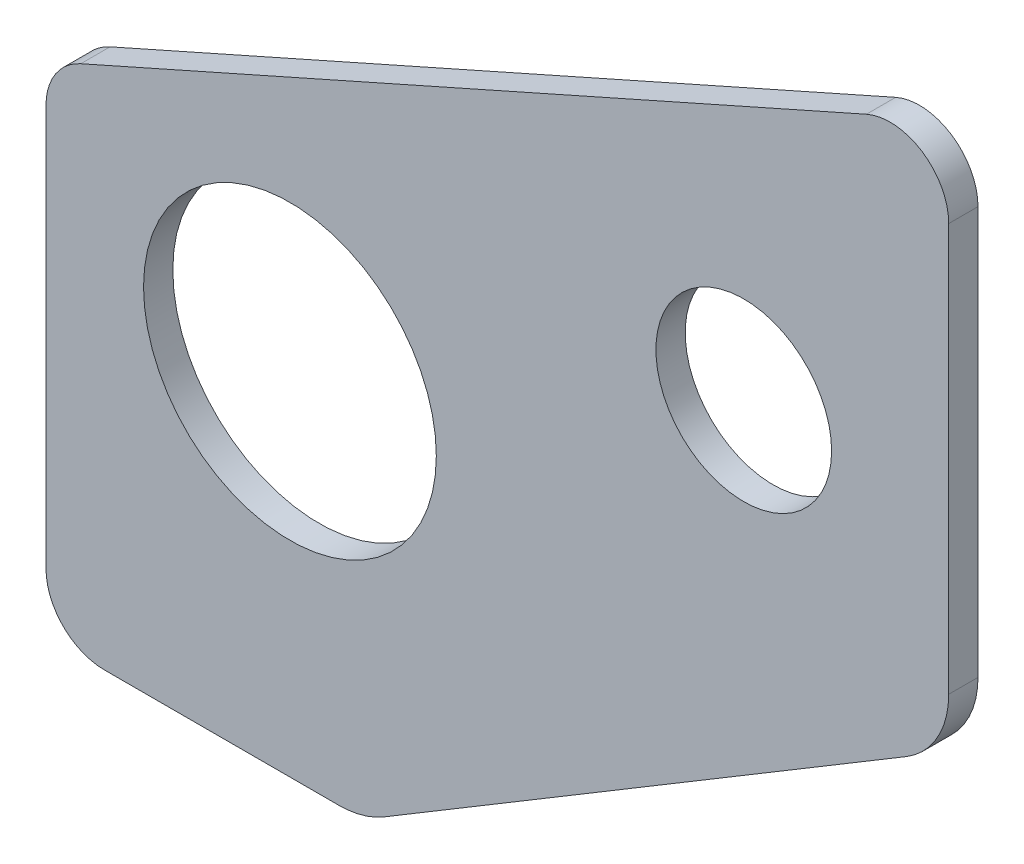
ISO-10303-21;
HEADER;
FILE_DESCRIPTION(('STEP AP214'),'2;1');
FILE_NAME('part.step','',(''),(''),'','','');
FILE_SCHEMA(('AUTOMOTIVE_DESIGN { 1 0 10303 214 1 1 1 1 }'));
ENDSEC;
DATA;
#1=APPLICATION_CONTEXT('core data for automotive mechanical design processes');
#2=APPLICATION_PROTOCOL_DEFINITION('international standard','automotive_design',2000,#1);
#3=PRODUCT_CONTEXT('',#1,'mechanical');
#4=PRODUCT('Part','Part','',(#3));
#5=PRODUCT_RELATED_PRODUCT_CATEGORY('part','',(#4));
#6=PRODUCT_DEFINITION_FORMATION('','',#4);
#7=PRODUCT_DEFINITION_CONTEXT('part definition',#1,'design');
#8=PRODUCT_DEFINITION('design','',#6,#7);
#9=PRODUCT_DEFINITION_SHAPE('','',#8);
#10=(LENGTH_UNIT() NAMED_UNIT(*) SI_UNIT(.MILLI.,.METRE.));
#11=(NAMED_UNIT(*) PLANE_ANGLE_UNIT() SI_UNIT($,.RADIAN.));
#12=(NAMED_UNIT(*) SI_UNIT($,.STERADIAN.) SOLID_ANGLE_UNIT());
#13=UNCERTAINTY_MEASURE_WITH_UNIT(LENGTH_MEASURE(1.E-05),#10,'distance_accuracy_value','');
#14=(GEOMETRIC_REPRESENTATION_CONTEXT(3) GLOBAL_UNCERTAINTY_ASSIGNED_CONTEXT((#13)) GLOBAL_UNIT_ASSIGNED_CONTEXT((#10,
#11,#12)) REPRESENTATION_CONTEXT('',''));
#15=CARTESIAN_POINT('',(0.,0.,0.));
#16=DIRECTION('',(0.,0.,1.));
#17=DIRECTION('',(1.,0.,0.));
#18=AXIS2_PLACEMENT_3D('',#15,#16,#17);
#19=CARTESIAN_POINT('',(14.3847558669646,58.8661644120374,-1.));
#20=DIRECTION('',(0.,0.,1.));
#21=DIRECTION('',(1.,0.,0.));
#22=AXIS2_PLACEMENT_3D('',#19,#20,#21);
#23=CYLINDRICAL_SURFACE('',#22,2.00000000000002);
#24=CARTESIAN_POINT('',(14.3847558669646,58.8661644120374,0.));
#25=DIRECTION('',(0.,0.,1.));
#26=DIRECTION('',(-1.,0.,0.));
#27=AXIS2_PLACEMENT_3D('',#24,#25,#26);
#28=CIRCLE('',#27,2.00000000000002);
#29=CARTESIAN_POINT('',(16.3847558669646,58.8661644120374,0.));
#30=VERTEX_POINT('',#29);
#31=CARTESIAN_POINT('',(13.5726806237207,60.6938771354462,0.));
#32=VERTEX_POINT('',#31);
#33=EDGE_CURVE('E141',#30,#32,#28,.T.);
#34=ORIENTED_EDGE('',*,*,#33,.F.);
#35=DIRECTION('',(0.,0.,1.));
#36=VECTOR('',#35,1.);
#37=CARTESIAN_POINT('',(16.3847558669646,58.8661644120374,-1.));
#38=LINE('',#37,#36);
#39=CARTESIAN_POINT('',(16.3847558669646,58.8661644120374,-1.));
#40=VERTEX_POINT('',#39);
#41=EDGE_CURVE('E11',#40,#30,#38,.T.);
#42=ORIENTED_EDGE('',*,*,#41,.F.);
#43=CARTESIAN_POINT('',(14.3847558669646,58.8661644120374,-1.));
#44=DIRECTION('',(0.,0.,1.));
#45=DIRECTION('',(-1.,0.,0.));
#46=AXIS2_PLACEMENT_3D('',#43,#44,#45);
#47=CIRCLE('',#46,2.00000000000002);
#48=CARTESIAN_POINT('',(13.5726806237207,60.6938771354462,-1.));
#49=VERTEX_POINT('',#48);
#50=EDGE_CURVE('E168',#40,#49,#47,.T.);
#51=ORIENTED_EDGE('',*,*,#50,.T.);
#52=DIRECTION('',(0.,0.,1.));
#53=VECTOR('',#52,1.);
#54=CARTESIAN_POINT('',(13.5726806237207,60.6938771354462,-1.));
#55=LINE('',#54,#53);
#56=EDGE_CURVE('E35',#49,#32,#55,.T.);
#57=ORIENTED_EDGE('',*,*,#56,.T.);
#58=EDGE_LOOP('',(#34,#42,#51,#57));
#59=FACE_BOUND('',#58,.T.);
#60=ADVANCED_FACE('F32',(#59),#23,.T.);
#61=CARTESIAN_POINT('',(16.3847558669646,58.8661644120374,-1.));
#62=DIRECTION('',(1.,0.,0.));
#63=DIRECTION('',(0.,0.,-1.));
#64=AXIS2_PLACEMENT_3D('',#61,#62,#63);
#65=PLANE('',#64);
#66=DIRECTION('',(0.,1.,0.));
#67=VECTOR('',#66,1.);
#68=CARTESIAN_POINT('',(16.3847558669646,58.8661644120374,0.));
#69=LINE('',#68,#67);
#70=CARTESIAN_POINT('',(16.3847558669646,44.9433167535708,0.));
#71=VERTEX_POINT('',#70);
#72=EDGE_CURVE('E166',#71,#30,#69,.T.);
#73=ORIENTED_EDGE('',*,*,#72,.F.);
#74=DIRECTION('',(0.,0.,1.));
#75=VECTOR('',#74,1.);
#76=CARTESIAN_POINT('',(16.3847558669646,44.9433167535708,-1.));
#77=LINE('',#76,#75);
#78=CARTESIAN_POINT('',(16.3847558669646,44.9433167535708,-1.));
#79=VERTEX_POINT('',#78);
#80=EDGE_CURVE('E41',#79,#71,#77,.T.);
#81=ORIENTED_EDGE('',*,*,#80,.F.);
#82=DIRECTION('',(0.,1.,0.));
#83=VECTOR('',#82,1.);
#84=CARTESIAN_POINT('',(16.3847558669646,58.8661644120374,-1.));
#85=LINE('',#84,#83);
#86=EDGE_CURVE('E131',#79,#40,#85,.T.);
#87=ORIENTED_EDGE('',*,*,#86,.T.);
#88=ORIENTED_EDGE('',*,*,#41,.T.);
#89=EDGE_LOOP('',(#73,#81,#87,#88));
#90=FACE_BOUND('',#89,.T.);
#91=ADVANCED_FACE('F184',(#90),#65,.T.);
#92=CARTESIAN_POINT('',(13.3847558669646,44.9433167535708,-1.));
#93=DIRECTION('',(0.,0.,1.));
#94=DIRECTION('',(1.,0.,0.));
#95=AXIS2_PLACEMENT_3D('',#92,#93,#94);
#96=CYLINDRICAL_SURFACE('',#95,3.00000000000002);
#97=CARTESIAN_POINT('',(13.3847558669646,44.9433167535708,0.));
#98=DIRECTION('',(0.,0.,1.));
#99=DIRECTION('',(-1.,0.,0.));
#100=AXIS2_PLACEMENT_3D('',#97,#98,#99);
#101=CIRCLE('',#100,3.00000000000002);
#102=CARTESIAN_POINT('',(14.9282431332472,42.3708379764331,0.));
#103=VERTEX_POINT('',#102);
#104=EDGE_CURVE('E118',#103,#71,#101,.T.);
#105=ORIENTED_EDGE('',*,*,#104,.F.);
#106=DIRECTION('',(0.,0.,1.));
#107=VECTOR('',#106,1.);
#108=CARTESIAN_POINT('',(14.9282431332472,42.3708379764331,-1.));
#109=LINE('',#108,#107);
#110=CARTESIAN_POINT('',(14.9282431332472,42.3708379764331,-1.));
#111=VERTEX_POINT('',#110);
#112=EDGE_CURVE('E113',#111,#103,#109,.T.);
#113=ORIENTED_EDGE('',*,*,#112,.F.);
#114=CARTESIAN_POINT('',(13.3847558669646,44.9433167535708,-1.));
#115=DIRECTION('',(0.,0.,1.));
#116=DIRECTION('',(-1.,0.,0.));
#117=AXIS2_PLACEMENT_3D('',#114,#115,#116);
#118=CIRCLE('',#117,3.00000000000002);
#119=EDGE_CURVE('E116',#111,#79,#118,.T.);
#120=ORIENTED_EDGE('',*,*,#119,.T.);
#121=ORIENTED_EDGE('',*,*,#80,.T.);
#122=EDGE_LOOP('',(#105,#113,#120,#121));
#123=FACE_BOUND('',#122,.T.);
#124=ADVANCED_FACE('F115',(#123),#96,.T.);
#125=CARTESIAN_POINT('',(14.9282431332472,42.3708379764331,-1.));
#126=DIRECTION('',(0.514495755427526,-0.857492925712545,0.));
#127=DIRECTION('',(0.857492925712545,0.514495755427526,0.));
#128=AXIS2_PLACEMENT_3D('',#125,#126,#127);
#129=PLANE('',#128);
#130=DIRECTION('',(0.857492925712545,0.514495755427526,0.));
#131=VECTOR('',#130,1.);
#132=CARTESIAN_POINT('',(14.9282431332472,42.3708379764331,0.));
#133=LINE('',#132,#131);
#134=CARTESIAN_POINT('',(-2.90270876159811,31.672266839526,0.));
#135=VERTEX_POINT('',#134);
#136=EDGE_CURVE('E163',#135,#103,#133,.T.);
#137=ORIENTED_EDGE('',*,*,#136,.F.);
#138=DIRECTION('',(0.,0.,1.));
#139=VECTOR('',#138,1.);
#140=CARTESIAN_POINT('',(-2.90270876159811,31.672266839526,-1.));
#141=LINE('',#140,#139);
#142=CARTESIAN_POINT('',(-2.90270876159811,31.672266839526,-1.));
#143=VERTEX_POINT('',#142);
#144=EDGE_CURVE('E123',#143,#135,#141,.T.);
#145=ORIENTED_EDGE('',*,*,#144,.F.);
#146=DIRECTION('',(0.857492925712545,0.514495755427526,0.));
#147=VECTOR('',#146,1.);
#148=CARTESIAN_POINT('',(14.9282431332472,42.3708379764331,-1.));
#149=LINE('',#148,#147);
#150=EDGE_CURVE('E129',#143,#111,#149,.T.);
#151=ORIENTED_EDGE('',*,*,#150,.T.);
#152=ORIENTED_EDGE('',*,*,#112,.T.);
#153=EDGE_LOOP('',(#137,#145,#151,#152));
#154=FACE_BOUND('',#153,.T.);
#155=ADVANCED_FACE('F133',(#154),#129,.T.);
#156=CARTESIAN_POINT('',(-4.4461960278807,34.2447456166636,-1.));
#157=DIRECTION('',(0.,0.,1.));
#158=DIRECTION('',(1.,0.,0.));
#159=AXIS2_PLACEMENT_3D('',#156,#157,#158);
#160=CYLINDRICAL_SURFACE('',#159,3.00000000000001);
#161=CARTESIAN_POINT('',(-4.4461960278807,34.2447456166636,0.));
#162=DIRECTION('',(0.,0.,1.));
#163=DIRECTION('',(-1.,0.,0.));
#164=AXIS2_PLACEMENT_3D('',#161,#162,#163);
#165=CIRCLE('',#164,3.00000000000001);
#166=CARTESIAN_POINT('',(-4.44619602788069,31.2447456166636,0.));
#167=VERTEX_POINT('',#166);
#168=EDGE_CURVE('E160',#167,#135,#165,.T.);
#169=ORIENTED_EDGE('',*,*,#168,.F.);
#170=DIRECTION('',(0.,0.,1.));
#171=VECTOR('',#170,1.);
#172=CARTESIAN_POINT('',(-4.44619602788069,31.2447456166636,-1.));
#173=LINE('',#172,#171);
#174=CARTESIAN_POINT('',(-4.44619602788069,31.2447456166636,-1.));
#175=VERTEX_POINT('',#174);
#176=EDGE_CURVE('E172',#175,#167,#173,.T.);
#177=ORIENTED_EDGE('',*,*,#176,.F.);
#178=CARTESIAN_POINT('',(-4.4461960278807,34.2447456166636,-1.));
#179=DIRECTION('',(0.,0.,1.));
#180=DIRECTION('',(-1.,0.,0.));
#181=AXIS2_PLACEMENT_3D('',#178,#179,#180);
#182=CIRCLE('',#181,3.00000000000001);
#183=EDGE_CURVE('E134',#175,#143,#182,.T.);
#184=ORIENTED_EDGE('',*,*,#183,.T.);
#185=ORIENTED_EDGE('',*,*,#144,.T.);
#186=EDGE_LOOP('',(#169,#177,#184,#185));
#187=FACE_BOUND('',#186,.T.);
#188=ADVANCED_FACE('F197',(#187),#160,.T.);
#189=CARTESIAN_POINT('',(-4.44619602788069,31.2447456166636,-1.));
#190=DIRECTION('',(0.,-1.,0.));
#191=DIRECTION('',(0.,0.,-1.));
#192=AXIS2_PLACEMENT_3D('',#189,#190,#191);
#193=PLANE('',#192);
#194=DIRECTION('',(1.,0.,0.));
#195=VECTOR('',#194,1.);
#196=CARTESIAN_POINT('',(-4.44619602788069,31.2447456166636,0.));
#197=LINE('',#196,#195);
#198=CARTESIAN_POINT('',(-12.4461960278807,31.2447456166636,0.));
#199=VERTEX_POINT('',#198);
#200=EDGE_CURVE('E157',#199,#167,#197,.T.);
#201=ORIENTED_EDGE('',*,*,#200,.F.);
#202=DIRECTION('',(0.,0.,1.));
#203=VECTOR('',#202,1.);
#204=CARTESIAN_POINT('',(-12.4461960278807,31.2447456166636,-1.));
#205=LINE('',#204,#203);
#206=CARTESIAN_POINT('',(-12.4461960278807,31.2447456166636,-1.));
#207=VERTEX_POINT('',#206);
#208=EDGE_CURVE('E174',#207,#199,#205,.T.);
#209=ORIENTED_EDGE('',*,*,#208,.F.);
#210=DIRECTION('',(1.,0.,0.));
#211=VECTOR('',#210,1.);
#212=CARTESIAN_POINT('',(-4.44619602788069,31.2447456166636,-1.));
#213=LINE('',#212,#211);
#214=EDGE_CURVE('E136',#207,#175,#213,.T.);
#215=ORIENTED_EDGE('',*,*,#214,.T.);
#216=ORIENTED_EDGE('',*,*,#176,.T.);
#217=EDGE_LOOP('',(#201,#209,#215,#216));
#218=FACE_BOUND('',#217,.T.);
#219=ADVANCED_FACE('F200',(#218),#193,.T.);
#220=CARTESIAN_POINT('',(-12.4461960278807,33.2447456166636,-1.));
#221=DIRECTION('',(0.,0.,1.));
#222=DIRECTION('',(1.,0.,0.));
#223=AXIS2_PLACEMENT_3D('',#220,#221,#222);
#224=CYLINDRICAL_SURFACE('',#223,2.00000000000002);
#225=CARTESIAN_POINT('',(-12.4461960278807,33.2447456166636,0.));
#226=DIRECTION('',(0.,0.,1.));
#227=DIRECTION('',(-1.,0.,0.));
#228=AXIS2_PLACEMENT_3D('',#225,#226,#227);
#229=CIRCLE('',#228,2.00000000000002);
#230=CARTESIAN_POINT('',(-14.4461960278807,33.2447456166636,0.));
#231=VERTEX_POINT('',#230);
#232=EDGE_CURVE('E154',#231,#199,#229,.T.);
#233=ORIENTED_EDGE('',*,*,#232,.F.);
#234=DIRECTION('',(0.,0.,1.));
#235=VECTOR('',#234,1.);
#236=CARTESIAN_POINT('',(-14.4461960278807,33.2447456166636,-1.));
#237=LINE('',#236,#235);
#238=CARTESIAN_POINT('',(-14.4461960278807,33.2447456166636,-1.));
#239=VERTEX_POINT('',#238);
#240=EDGE_CURVE('E176',#239,#231,#237,.T.);
#241=ORIENTED_EDGE('',*,*,#240,.F.);
#242=CARTESIAN_POINT('',(-12.4461960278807,33.2447456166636,-1.));
#243=DIRECTION('',(0.,0.,1.));
#244=DIRECTION('',(-1.,0.,0.));
#245=AXIS2_PLACEMENT_3D('',#242,#243,#244);
#246=CIRCLE('',#245,2.00000000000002);
#247=EDGE_CURVE('E260',#239,#207,#246,.T.);
#248=ORIENTED_EDGE('',*,*,#247,.T.);
#249=ORIENTED_EDGE('',*,*,#208,.T.);
#250=EDGE_LOOP('',(#233,#241,#248,#249));
#251=FACE_BOUND('',#250,.T.);
#252=ADVANCED_FACE('F204',(#251),#224,.T.);
#253=CARTESIAN_POINT('',(-14.4461960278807,33.2447456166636,-1.));
#254=DIRECTION('',(-1.,0.,0.));
#255=DIRECTION('',(0.,0.,1.));
#256=AXIS2_PLACEMENT_3D('',#253,#254,#255);
#257=PLANE('',#256);
#258=DIRECTION('',(0.,-1.,0.));
#259=VECTOR('',#258,1.);
#260=CARTESIAN_POINT('',(-14.4461960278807,33.2447456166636,0.));
#261=LINE('',#260,#259);
#262=CARTESIAN_POINT('',(-14.4461960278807,46.9448424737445,0.));
#263=VERTEX_POINT('',#262);
#264=EDGE_CURVE('E151',#263,#231,#261,.T.);
#265=ORIENTED_EDGE('',*,*,#264,.F.);
#266=DIRECTION('',(0.,0.,1.));
#267=VECTOR('',#266,1.);
#268=CARTESIAN_POINT('',(-14.4461960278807,46.9448424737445,-1.));
#269=LINE('',#268,#267);
#270=CARTESIAN_POINT('',(-14.4461960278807,46.9448424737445,-1.));
#271=VERTEX_POINT('',#270);
#272=EDGE_CURVE('E178',#271,#263,#269,.T.);
#273=ORIENTED_EDGE('',*,*,#272,.F.);
#274=DIRECTION('',(0.,-1.,0.));
#275=VECTOR('',#274,1.);
#276=CARTESIAN_POINT('',(-14.4461960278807,33.2447456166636,-1.));
#277=LINE('',#276,#275);
#278=EDGE_CURVE('E257',#271,#239,#277,.T.);
#279=ORIENTED_EDGE('',*,*,#278,.T.);
#280=ORIENTED_EDGE('',*,*,#240,.T.);
#281=EDGE_LOOP('',(#265,#273,#279,#280));
#282=FACE_BOUND('',#281,.T.);
#283=ADVANCED_FACE('F208',(#282),#257,.T.);
#284=CARTESIAN_POINT('',(-12.4461960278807,46.9448424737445,-1.));
#285=DIRECTION('',(0.,0.,1.));
#286=DIRECTION('',(1.,0.,0.));
#287=AXIS2_PLACEMENT_3D('',#284,#285,#286);
#288=CYLINDRICAL_SURFACE('',#287,2.00000000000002);
#289=CARTESIAN_POINT('',(-12.4461960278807,46.9448424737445,0.));
#290=DIRECTION('',(0.,0.,1.));
#291=DIRECTION('',(1.,0.,0.));
#292=AXIS2_PLACEMENT_3D('',#289,#290,#291);
#293=CIRCLE('',#292,2.00000000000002);
#294=CARTESIAN_POINT('',(-13.2582712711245,48.7725551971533,0.));
#295=VERTEX_POINT('',#294);
#296=EDGE_CURVE('E148',#295,#263,#293,.T.);
#297=ORIENTED_EDGE('',*,*,#296,.F.);
#298=DIRECTION('',(0.,0.,1.));
#299=VECTOR('',#298,1.);
#300=CARTESIAN_POINT('',(-13.2582712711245,48.7725551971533,-1.));
#301=LINE('',#300,#299);
#302=CARTESIAN_POINT('',(-13.2582712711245,48.7725551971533,-1.));
#303=VERTEX_POINT('',#302);
#304=EDGE_CURVE('E179',#303,#295,#301,.T.);
#305=ORIENTED_EDGE('',*,*,#304,.F.);
#306=CARTESIAN_POINT('',(-12.4461960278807,46.9448424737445,-1.));
#307=DIRECTION('',(0.,0.,1.));
#308=DIRECTION('',(1.,0.,0.));
#309=AXIS2_PLACEMENT_3D('',#306,#307,#308);
#310=CIRCLE('',#309,2.00000000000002);
#311=EDGE_CURVE('E254',#303,#271,#310,.T.);
#312=ORIENTED_EDGE('',*,*,#311,.T.);
#313=ORIENTED_EDGE('',*,*,#272,.T.);
#314=EDGE_LOOP('',(#297,#305,#312,#313));
#315=FACE_BOUND('',#314,.T.);
#316=ADVANCED_FACE('F212',(#315),#288,.T.);
#317=CARTESIAN_POINT('',(13.5726806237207,60.6938771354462,-1.));
#318=DIRECTION('',(-0.406037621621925,0.913856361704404,0.));
#319=DIRECTION('',(-0.913856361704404,-0.406037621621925,0.));
#320=AXIS2_PLACEMENT_3D('',#317,#318,#319);
#321=PLANE('',#320);
#322=DIRECTION('',(-0.913856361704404,-0.406037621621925,0.));
#323=VECTOR('',#322,1.);
#324=CARTESIAN_POINT('',(13.5726806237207,60.6938771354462,0.));
#325=LINE('',#324,#323);
#326=EDGE_CURVE('E144',#32,#295,#325,.T.);
#327=ORIENTED_EDGE('',*,*,#326,.F.);
#328=ORIENTED_EDGE('',*,*,#56,.F.);
#329=DIRECTION('',(-0.913856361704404,-0.406037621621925,0.));
#330=VECTOR('',#329,1.);
#331=CARTESIAN_POINT('',(13.5726806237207,60.6938771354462,-1.));
#332=LINE('',#331,#330);
#333=EDGE_CURVE('E252',#49,#303,#332,.T.);
#334=ORIENTED_EDGE('',*,*,#333,.T.);
#335=ORIENTED_EDGE('',*,*,#304,.T.);
#336=EDGE_LOOP('',(#327,#328,#334,#335));
#337=FACE_BOUND('',#336,.T.);
#338=ADVANCED_FACE('F181',(#337),#321,.T.);
#339=CARTESIAN_POINT('',(14.3847558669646,58.8661644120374,-1.));
#340=DIRECTION('',(0.,0.,-1.));
#341=DIRECTION('',(-1.,0.,0.));
#342=AXIS2_PLACEMENT_3D('',#339,#340,#341);
#343=PLANE('',#342);
#344=CARTESIAN_POINT('',(-6.11524413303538,43.2447456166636,-1.));
#345=DIRECTION('',(0.,0.,1.));
#346=DIRECTION('',(1.,0.,0.));
#347=AXIS2_PLACEMENT_3D('',#344,#345,#346);
#348=CIRCLE('',#347,5.);
#349=CARTESIAN_POINT('',(-1.11524413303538,43.2447456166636,-1.));
#350=VERTEX_POINT('',#349);
#351=EDGE_CURVE('E239',#350,#350,#348,.T.);
#352=ORIENTED_EDGE('',*,*,#351,.T.);
#353=EDGE_LOOP('',(#352));
#354=FACE_BOUND('',#353,.T.);
#355=CARTESIAN_POINT('',(9.38475586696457,50.1394691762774,-1.));
#356=DIRECTION('',(0.,0.,1.));
#357=DIRECTION('',(1.,0.,0.));
#358=AXIS2_PLACEMENT_3D('',#355,#356,#357);
#359=CIRCLE('',#358,3.);
#360=CARTESIAN_POINT('',(12.3847558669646,50.1394691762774,-1.));
#361=VERTEX_POINT('',#360);
#362=EDGE_CURVE('E145',#361,#361,#359,.T.);
#363=ORIENTED_EDGE('',*,*,#362,.T.);
#364=EDGE_LOOP('',(#363));
#365=FACE_BOUND('',#364,.T.);
#366=ORIENTED_EDGE('',*,*,#50,.F.);
#367=ORIENTED_EDGE('',*,*,#86,.F.);
#368=ORIENTED_EDGE('',*,*,#119,.F.);
#369=ORIENTED_EDGE('',*,*,#150,.F.);
#370=ORIENTED_EDGE('',*,*,#183,.F.);
#371=ORIENTED_EDGE('',*,*,#214,.F.);
#372=ORIENTED_EDGE('',*,*,#247,.F.);
#373=ORIENTED_EDGE('',*,*,#278,.F.);
#374=ORIENTED_EDGE('',*,*,#311,.F.);
#375=ORIENTED_EDGE('',*,*,#333,.F.);
#376=EDGE_LOOP('',(#366,#367,#368,#369,#370,#371,#372,#373,#374,#375));
#377=FACE_BOUND('',#376,.T.);
#378=ADVANCED_FACE('F127',(#354,#365,#377),#343,.T.);
#379=CARTESIAN_POINT('',(14.3847558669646,58.8661644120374,0.));
#380=DIRECTION('',(0.,0.,-1.));
#381=DIRECTION('',(-1.,0.,0.));
#382=AXIS2_PLACEMENT_3D('',#379,#380,#381);
#383=PLANE('',#382);
#384=CARTESIAN_POINT('',(-6.11524413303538,43.2447456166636,0.));
#385=DIRECTION('',(0.,0.,1.));
#386=DIRECTION('',(1.,0.,0.));
#387=AXIS2_PLACEMENT_3D('',#384,#385,#386);
#388=CIRCLE('',#387,5.);
#389=CARTESIAN_POINT('',(-1.11524413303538,43.2447456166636,0.));
#390=VERTEX_POINT('',#389);
#391=EDGE_CURVE('E242',#390,#390,#388,.T.);
#392=ORIENTED_EDGE('',*,*,#391,.F.);
#393=EDGE_LOOP('',(#392));
#394=FACE_BOUND('',#393,.T.);
#395=CARTESIAN_POINT('',(9.38475586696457,50.1394691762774,0.));
#396=DIRECTION('',(0.,0.,1.));
#397=DIRECTION('',(1.,0.,0.));
#398=AXIS2_PLACEMENT_3D('',#395,#396,#397);
#399=CIRCLE('',#398,3.);
#400=CARTESIAN_POINT('',(12.3847558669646,50.1394691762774,0.));
#401=VERTEX_POINT('',#400);
#402=EDGE_CURVE('E244',#401,#401,#399,.T.);
#403=ORIENTED_EDGE('',*,*,#402,.F.);
#404=EDGE_LOOP('',(#403));
#405=FACE_BOUND('',#404,.T.);
#406=ORIENTED_EDGE('',*,*,#33,.T.);
#407=ORIENTED_EDGE('',*,*,#326,.T.);
#408=ORIENTED_EDGE('',*,*,#296,.T.);
#409=ORIENTED_EDGE('',*,*,#264,.T.);
#410=ORIENTED_EDGE('',*,*,#232,.T.);
#411=ORIENTED_EDGE('',*,*,#200,.T.);
#412=ORIENTED_EDGE('',*,*,#168,.T.);
#413=ORIENTED_EDGE('',*,*,#136,.T.);
#414=ORIENTED_EDGE('',*,*,#104,.T.);
#415=ORIENTED_EDGE('',*,*,#72,.T.);
#416=EDGE_LOOP('',(#406,#407,#408,#409,#410,#411,#412,#413,#414,#415));
#417=FACE_BOUND('',#416,.T.);
#418=ADVANCED_FACE('F183',(#394,#405,#417),#383,.F.);
#419=CARTESIAN_POINT('',(9.38475586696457,50.1394691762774,-1.));
#420=DIRECTION('',(0.,0.,1.));
#421=DIRECTION('',(1.,0.,0.));
#422=AXIS2_PLACEMENT_3D('',#419,#420,#421);
#423=CYLINDRICAL_SURFACE('',#422,3.);
#424=ORIENTED_EDGE('',*,*,#362,.F.);
#425=EDGE_LOOP('',(#424));
#426=FACE_BOUND('',#425,.T.);
#427=ORIENTED_EDGE('',*,*,#402,.T.);
#428=EDGE_LOOP('',(#427));
#429=FACE_BOUND('',#428,.T.);
#430=ADVANCED_FACE('F224',(#426,#429),#423,.F.);
#431=CARTESIAN_POINT('',(-6.11524413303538,43.2447456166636,-1.));
#432=DIRECTION('',(0.,0.,1.));
#433=DIRECTION('',(1.,0.,0.));
#434=AXIS2_PLACEMENT_3D('',#431,#432,#433);
#435=CYLINDRICAL_SURFACE('',#434,5.);
#436=ORIENTED_EDGE('',*,*,#351,.F.);
#437=EDGE_LOOP('',(#436));
#438=FACE_BOUND('',#437,.T.);
#439=ORIENTED_EDGE('',*,*,#391,.T.);
#440=EDGE_LOOP('',(#439));
#441=FACE_BOUND('',#440,.T.);
#442=ADVANCED_FACE('F231',(#438,#441),#435,.F.);
#443=CLOSED_SHELL('',(#60,#91,#124,#155,#188,#219,#252,#283,#316,#338,#378,#418,#430,#442));
#444=MANIFOLD_SOLID_BREP('B2',#443);
#445=ADVANCED_BREP_SHAPE_REPRESENTATION('',(#18,#444),#14);
#446=SHAPE_DEFINITION_REPRESENTATION(#9,#445);
ENDSEC;
END-ISO-10303-21;
